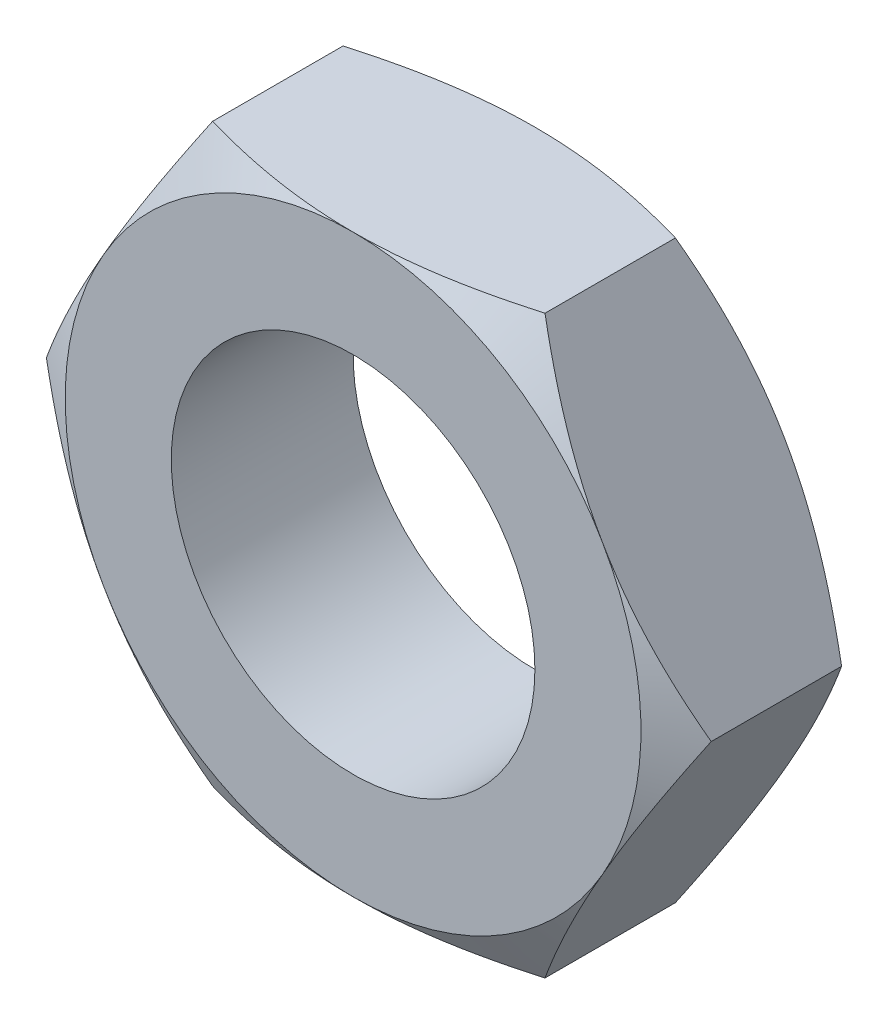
from build123d import *

# Parameters (mm, degrees)
SKETCH1_R      = 6
EXTRUDE1_DEPTH = 3


with BuildPart() as part:
    # Sketch1 → Extrude1 (new, symmetric)
    with BuildSketch(Plane.XY):
        Polygon((5.484827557, 9.5), (-5.484827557, 9.5), (-10.969655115, 0), (-5.484827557, -9.5), (5.484827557, -9.5), (10.969655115, 0), align=None)
        Circle(SKETCH1_R, mode=Mode.SUBTRACT)
    extrude(amount=EXTRUDE1_DEPTH, both=True)

    # Sketch2 → Cut-Revolve1 (revolve, cut)
    with BuildSketch(Plane(origin=(0, 0, 0), x_dir=(0, 0, -1), z_dir=(1, 0, 0))):
        Polygon((-3, 9.5), (-3, 19), (2.484827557, 19), align=None)
    cut_revolve1 = revolve(axis=Axis((0, 0, 3), (0, 0, -1)), mode=Mode.SUBTRACT)

    # Mirror1: Cut-Revolve1 across plane
    add(cut_revolve1.mirror(Plane.XY), mode=Mode.SUBTRACT)


solid = part.part
